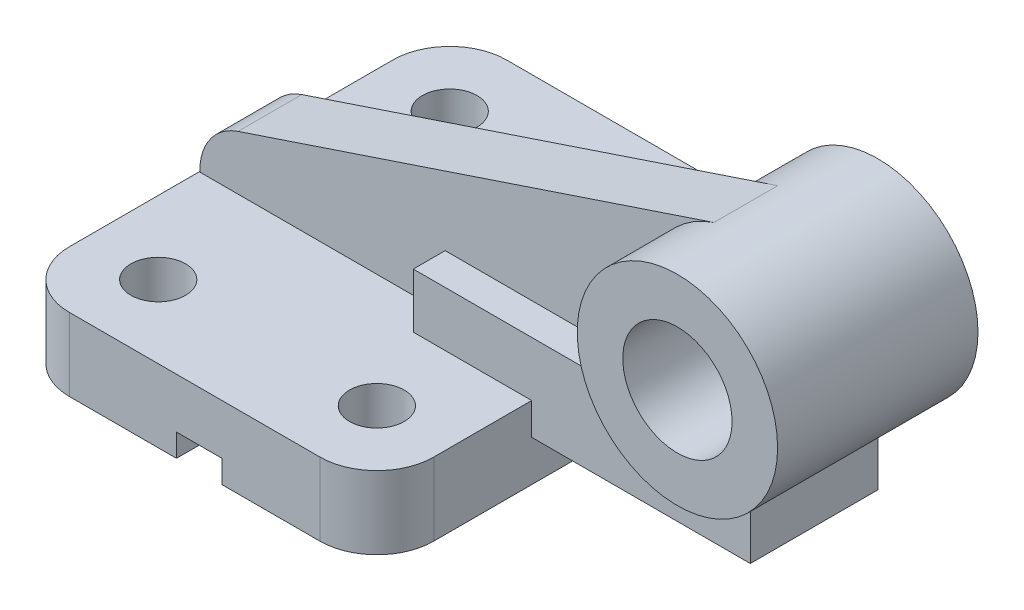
ISO-10303-21;
HEADER;
FILE_DESCRIPTION(('STEP AP214'),'2;1');
FILE_NAME('part.step','',(''),(''),'','','');
FILE_SCHEMA(('AUTOMOTIVE_DESIGN { 1 0 10303 214 1 1 1 1 }'));
ENDSEC;
DATA;
#1=APPLICATION_CONTEXT('core data for automotive mechanical design processes');
#2=APPLICATION_PROTOCOL_DEFINITION('international standard','automotive_design',2000,#1);
#3=PRODUCT_CONTEXT('',#1,'mechanical');
#4=PRODUCT('Part','Part','',(#3));
#5=PRODUCT_RELATED_PRODUCT_CATEGORY('part','',(#4));
#6=PRODUCT_DEFINITION_FORMATION('','',#4);
#7=PRODUCT_DEFINITION_CONTEXT('part definition',#1,'design');
#8=PRODUCT_DEFINITION('design','',#6,#7);
#9=PRODUCT_DEFINITION_SHAPE('','',#8);
#10=(LENGTH_UNIT() NAMED_UNIT(*) SI_UNIT(.MILLI.,.METRE.));
#11=(NAMED_UNIT(*) PLANE_ANGLE_UNIT() SI_UNIT($,.RADIAN.));
#12=(NAMED_UNIT(*) SI_UNIT($,.STERADIAN.) SOLID_ANGLE_UNIT());
#13=UNCERTAINTY_MEASURE_WITH_UNIT(LENGTH_MEASURE(1.E-05),#10,'distance_accuracy_value','');
#14=(GEOMETRIC_REPRESENTATION_CONTEXT(3) GLOBAL_UNCERTAINTY_ASSIGNED_CONTEXT((#13)) GLOBAL_UNIT_ASSIGNED_CONTEXT((#10,
#11,#12)) REPRESENTATION_CONTEXT('',''));
#15=CARTESIAN_POINT('',(0.,0.,0.));
#16=DIRECTION('',(0.,0.,1.));
#17=DIRECTION('',(1.,0.,0.));
#18=AXIS2_PLACEMENT_3D('',#15,#16,#17);
#19=CARTESIAN_POINT('',(-80.,-84.,-70.9999999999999));
#20=DIRECTION('',(1.,0.,0.));
#21=DIRECTION('',(0.,0.,-1.));
#22=AXIS2_PLACEMENT_3D('',#19,#20,#21);
#23=PLANE('',#22);
#24=DIRECTION('',(0.,0.,-1.));
#25=VECTOR('',#24,1.);
#26=CARTESIAN_POINT('',(-80.,-52.,-70.9999999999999));
#27=LINE('',#26,#25);
#28=CARTESIAN_POINT('',(-80.,-52.,-28.));
#29=VERTEX_POINT('',#28);
#30=CARTESIAN_POINT('',(-80.,-52.,-70.9999999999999));
#31=VERTEX_POINT('',#30);
#32=EDGE_CURVE('E424',#29,#31,#27,.T.);
#33=ORIENTED_EDGE('',*,*,#32,.F.);
#34=DIRECTION('',(0.,-1.,0.));
#35=VECTOR('',#34,1.);
#36=CARTESIAN_POINT('',(-80.,-184.616573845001,-28.));
#37=LINE('',#36,#35);
#38=CARTESIAN_POINT('',(-80.,-66.,-28.));
#39=VERTEX_POINT('',#38);
#40=EDGE_CURVE('E271',#29,#39,#37,.T.);
#41=ORIENTED_EDGE('',*,*,#40,.T.);
#42=DIRECTION('',(0.,0.,1.));
#43=VECTOR('',#42,1.);
#44=CARTESIAN_POINT('',(-80.,-66.,-28.));
#45=LINE('',#44,#43);
#46=CARTESIAN_POINT('',(-80.,-66.,28.));
#47=VERTEX_POINT('',#46);
#48=EDGE_CURVE('E279',#39,#47,#45,.T.);
#49=ORIENTED_EDGE('',*,*,#48,.T.);
#50=DIRECTION('',(0.,-1.,0.));
#51=VECTOR('',#50,1.);
#52=CARTESIAN_POINT('',(-80.,-184.616573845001,28.));
#53=LINE('',#52,#51);
#54=CARTESIAN_POINT('',(-80.,-52.,28.));
#55=VERTEX_POINT('',#54);
#56=EDGE_CURVE('E255',#55,#47,#53,.T.);
#57=ORIENTED_EDGE('',*,*,#56,.F.);
#58=CARTESIAN_POINT('',(-80.,-52.,70.9999999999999));
#59=VERTEX_POINT('',#58);
#60=EDGE_CURVE('E425',#59,#55,#27,.T.);
#61=ORIENTED_EDGE('',*,*,#60,.F.);
#62=DIRECTION('',(0.,1.,0.));
#63=VECTOR('',#62,1.);
#64=CARTESIAN_POINT('',(-80.,-84.,70.9999999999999));
#65=LINE('',#64,#63);
#66=CARTESIAN_POINT('',(-80.,-84.,70.9999999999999));
#67=VERTEX_POINT('',#66);
#68=EDGE_CURVE('E440',#67,#59,#65,.T.);
#69=ORIENTED_EDGE('',*,*,#68,.F.);
#70=DIRECTION('',(0.,0.,-1.));
#71=VECTOR('',#70,1.);
#72=CARTESIAN_POINT('',(-80.,-84.,-70.9999999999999));
#73=LINE('',#72,#71);
#74=CARTESIAN_POINT('',(-80.,-84.,-70.9999999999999));
#75=VERTEX_POINT('',#74);
#76=EDGE_CURVE('E399',#67,#75,#73,.T.);
#77=ORIENTED_EDGE('',*,*,#76,.T.);
#78=DIRECTION('',(0.,1.,0.));
#79=VECTOR('',#78,1.);
#80=CARTESIAN_POINT('',(-80.,-84.,-70.9999999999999));
#81=LINE('',#80,#79);
#82=EDGE_CURVE('E437',#75,#31,#81,.T.);
#83=ORIENTED_EDGE('',*,*,#82,.T.);
#84=EDGE_LOOP('',(#33,#41,#49,#57,#61,#69,#77,#83));
#85=FACE_BOUND('',#84,.T.);
#86=ADVANCED_FACE('F31',(#85),#23,.T.);
#87=CARTESIAN_POINT('',(-215.,-84.,-71.));
#88=DIRECTION('',(0.,-1.,0.));
#89=DIRECTION('',(0.,0.,-1.));
#90=AXIS2_PLACEMENT_3D('',#87,#88,#89);
#91=PLANE('',#90);
#92=DIRECTION('',(0.,0.,-1.));
#93=VECTOR('',#92,1.);
#94=CARTESIAN_POINT('',(-168.,-84.,-71.));
#95=LINE('',#94,#93);
#96=CARTESIAN_POINT('',(-168.,-84.,96.));
#97=VERTEX_POINT('',#96);
#98=CARTESIAN_POINT('',(-168.,-84.,-96.));
#99=VERTEX_POINT('',#98);
#100=EDGE_CURVE('E11',#97,#99,#95,.T.);
#101=ORIENTED_EDGE('',*,*,#100,.F.);
#102=DIRECTION('',(1.,0.,0.));
#103=VECTOR('',#102,1.);
#104=CARTESIAN_POINT('',(-105.,-84.,96.));
#105=LINE('',#104,#103);
#106=CARTESIAN_POINT('',(-215.,-84.,96.));
#107=VERTEX_POINT('',#106);
#108=EDGE_CURVE('E393',#107,#97,#105,.T.);
#109=ORIENTED_EDGE('',*,*,#108,.F.);
#110=CARTESIAN_POINT('',(-215.,-84.,71.));
#111=DIRECTION('',(0.,1.,0.));
#112=DIRECTION('',(0.,0.,-1.));
#113=AXIS2_PLACEMENT_3D('',#110,#111,#112);
#114=CIRCLE('',#113,25.);
#115=CARTESIAN_POINT('',(-240.,-84.,70.9999999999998));
#116=VERTEX_POINT('',#115);
#117=EDGE_CURVE('E389',#116,#107,#114,.T.);
#118=ORIENTED_EDGE('',*,*,#117,.F.);
#119=DIRECTION('',(0.,0.,1.));
#120=VECTOR('',#119,1.);
#121=CARTESIAN_POINT('',(-240.,-84.,70.9999999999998));
#122=LINE('',#121,#120);
#123=CARTESIAN_POINT('',(-240.,-84.,-70.9999999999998));
#124=VERTEX_POINT('',#123);
#125=EDGE_CURVE('E385',#124,#116,#122,.T.);
#126=ORIENTED_EDGE('',*,*,#125,.F.);
#127=CARTESIAN_POINT('',(-215.,-84.,-71.));
#128=DIRECTION('',(0.,1.,0.));
#129=DIRECTION('',(0.,0.,-1.));
#130=AXIS2_PLACEMENT_3D('',#127,#128,#129);
#131=CIRCLE('',#130,25.);
#132=CARTESIAN_POINT('',(-215.,-84.,-96.));
#133=VERTEX_POINT('',#132);
#134=EDGE_CURVE('E382',#133,#124,#131,.T.);
#135=ORIENTED_EDGE('',*,*,#134,.F.);
#136=DIRECTION('',(-1.,0.,0.));
#137=VECTOR('',#136,1.);
#138=CARTESIAN_POINT('',(-215.,-84.,-96.));
#139=LINE('',#138,#137);
#140=EDGE_CURVE('E405',#99,#133,#139,.T.);
#141=ORIENTED_EDGE('',*,*,#140,.F.);
#142=EDGE_LOOP('',(#101,#109,#118,#126,#135,#141));
#143=FACE_BOUND('',#142,.T.);
#144=CARTESIAN_POINT('',(-208.,-84.,64.));
#145=DIRECTION('',(0.,1.,0.));
#146=DIRECTION('',(0.,0.,1.));
#147=AXIS2_PLACEMENT_3D('',#144,#145,#146);
#148=CIRCLE('',#147,12.);
#149=CARTESIAN_POINT('',(-208.,-84.,76.));
#150=VERTEX_POINT('',#149);
#151=EDGE_CURVE('E355',#150,#150,#148,.T.);
#152=ORIENTED_EDGE('',*,*,#151,.T.);
#153=EDGE_LOOP('',(#152));
#154=FACE_BOUND('',#153,.T.);
#155=CARTESIAN_POINT('',(-208.,-84.,-64.));
#156=DIRECTION('',(0.,-1.,0.));
#157=DIRECTION('',(0.,0.,-1.));
#158=AXIS2_PLACEMENT_3D('',#155,#156,#157);
#159=CIRCLE('',#158,12.);
#160=CARTESIAN_POINT('',(-208.,-84.,-76.));
#161=VERTEX_POINT('',#160);
#162=EDGE_CURVE('E349',#161,#161,#159,.T.);
#163=ORIENTED_EDGE('',*,*,#162,.F.);
#164=EDGE_LOOP('',(#163));
#165=FACE_BOUND('',#164,.T.);
#166=ADVANCED_FACE('F480',(#143,#154,#165),#91,.T.);
#167=CARTESIAN_POINT('',(-215.,-52.,-71.));
#168=DIRECTION('',(0.,-1.,0.));
#169=DIRECTION('',(0.,0.,-1.));
#170=AXIS2_PLACEMENT_3D('',#167,#168,#169);
#171=PLANE('',#170);
#172=CARTESIAN_POINT('',(-112.,-52.,-64.));
#173=DIRECTION('',(0.,1.,0.));
#174=DIRECTION('',(0.,0.,1.));
#175=AXIS2_PLACEMENT_3D('',#172,#173,#174);
#176=CIRCLE('',#175,12.);
#177=CARTESIAN_POINT('',(-112.,-52.,-52.));
#178=VERTEX_POINT('',#177);
#179=EDGE_CURVE('E332',#178,#178,#176,.T.);
#180=ORIENTED_EDGE('',*,*,#179,.F.);
#181=EDGE_LOOP('',(#180));
#182=FACE_BOUND('',#181,.T.);
#183=CARTESIAN_POINT('',(-112.,-52.,64.));
#184=DIRECTION('',(0.,1.,0.));
#185=DIRECTION('',(0.,0.,1.));
#186=AXIS2_PLACEMENT_3D('',#183,#184,#185);
#187=CIRCLE('',#186,12.);
#188=CARTESIAN_POINT('',(-112.,-52.,76.));
#189=VERTEX_POINT('',#188);
#190=EDGE_CURVE('E340',#189,#189,#187,.T.);
#191=ORIENTED_EDGE('',*,*,#190,.F.);
#192=EDGE_LOOP('',(#191));
#193=FACE_BOUND('',#192,.T.);
#194=DIRECTION('',(1.,0.,0.));
#195=VECTOR('',#194,1.);
#196=CARTESIAN_POINT('',(-239.716547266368,-52.,-14.));
#197=LINE('',#196,#195);
#198=CARTESIAN_POINT('',(-239.716547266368,-52.,-14.));
#199=VERTEX_POINT('',#198);
#200=CARTESIAN_POINT('',(-132.,-52.,-14.));
#201=VERTEX_POINT('',#200);
#202=EDGE_CURVE('E322',#199,#201,#197,.T.);
#203=ORIENTED_EDGE('',*,*,#202,.T.);
#204=DIRECTION('',(0.,0.,1.));
#205=VECTOR('',#204,1.);
#206=CARTESIAN_POINT('',(-132.,-52.,-28.));
#207=LINE('',#206,#205);
#208=CARTESIAN_POINT('',(-132.,-52.,-28.));
#209=VERTEX_POINT('',#208);
#210=EDGE_CURVE('E282',#209,#201,#207,.T.);
#211=ORIENTED_EDGE('',*,*,#210,.F.);
#212=DIRECTION('',(1.,0.,0.));
#213=VECTOR('',#212,1.);
#214=CARTESIAN_POINT('',(-37.1698318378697,-52.,-28.));
#215=LINE('',#214,#213);
#216=EDGE_CURVE('E268',#209,#29,#215,.T.);
#217=ORIENTED_EDGE('',*,*,#216,.T.);
#218=ORIENTED_EDGE('',*,*,#32,.T.);
#219=CARTESIAN_POINT('',(-105.,-52.,-71.));
#220=DIRECTION('',(0.,1.,0.));
#221=DIRECTION('',(0.,0.,1.));
#222=AXIS2_PLACEMENT_3D('',#219,#220,#221);
#223=CIRCLE('',#222,25.);
#224=CARTESIAN_POINT('',(-105.,-52.,-96.));
#225=VERTEX_POINT('',#224);
#226=EDGE_CURVE('E428',#31,#225,#223,.T.);
#227=ORIENTED_EDGE('',*,*,#226,.T.);
#228=DIRECTION('',(-1.,0.,0.));
#229=VECTOR('',#228,1.);
#230=CARTESIAN_POINT('',(-215.,-52.,-96.));
#231=LINE('',#230,#229);
#232=CARTESIAN_POINT('',(-215.,-52.,-96.));
#233=VERTEX_POINT('',#232);
#234=EDGE_CURVE('E386',#225,#233,#231,.T.);
#235=ORIENTED_EDGE('',*,*,#234,.T.);
#236=CARTESIAN_POINT('',(-215.,-52.,-71.));
#237=DIRECTION('',(0.,1.,0.));
#238=DIRECTION('',(0.,0.,-1.));
#239=AXIS2_PLACEMENT_3D('',#236,#237,#238);
#240=CIRCLE('',#239,25.);
#241=CARTESIAN_POINT('',(-240.,-52.,-70.9999999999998));
#242=VERTEX_POINT('',#241);
#243=EDGE_CURVE('E379',#233,#242,#240,.T.);
#244=ORIENTED_EDGE('',*,*,#243,.T.);
#245=DIRECTION('',(0.,0.,1.));
#246=VECTOR('',#245,1.);
#247=CARTESIAN_POINT('',(-240.,-52.,70.9999999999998));
#248=LINE('',#247,#246);
#249=CARTESIAN_POINT('',(-240.,-52.,70.9999999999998));
#250=VERTEX_POINT('',#249);
#251=EDGE_CURVE('E412',#242,#250,#248,.T.);
#252=ORIENTED_EDGE('',*,*,#251,.T.);
#253=CARTESIAN_POINT('',(-215.,-52.,71.));
#254=DIRECTION('',(0.,1.,0.));
#255=DIRECTION('',(0.,0.,-1.));
#256=AXIS2_PLACEMENT_3D('',#253,#254,#255);
#257=CIRCLE('',#256,25.);
#258=CARTESIAN_POINT('',(-215.,-52.,96.));
#259=VERTEX_POINT('',#258);
#260=EDGE_CURVE('E415',#250,#259,#257,.T.);
#261=ORIENTED_EDGE('',*,*,#260,.T.);
#262=DIRECTION('',(1.,0.,0.));
#263=VECTOR('',#262,1.);
#264=CARTESIAN_POINT('',(-105.,-52.,96.));
#265=LINE('',#264,#263);
#266=CARTESIAN_POINT('',(-105.,-52.,96.));
#267=VERTEX_POINT('',#266);
#268=EDGE_CURVE('E418',#259,#267,#265,.T.);
#269=ORIENTED_EDGE('',*,*,#268,.T.);
#270=CARTESIAN_POINT('',(-105.,-52.,71.));
#271=DIRECTION('',(0.,1.,0.));
#272=DIRECTION('',(0.,0.,1.));
#273=AXIS2_PLACEMENT_3D('',#270,#271,#272);
#274=CIRCLE('',#273,25.);
#275=EDGE_CURVE('E421',#267,#59,#274,.T.);
#276=ORIENTED_EDGE('',*,*,#275,.T.);
#277=ORIENTED_EDGE('',*,*,#60,.T.);
#278=DIRECTION('',(1.,0.,0.));
#279=VECTOR('',#278,1.);
#280=CARTESIAN_POINT('',(-37.1698318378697,-52.,28.));
#281=LINE('',#280,#279);
#282=CARTESIAN_POINT('',(-132.,-52.,28.));
#283=VERTEX_POINT('',#282);
#284=EDGE_CURVE('E253',#283,#55,#281,.T.);
#285=ORIENTED_EDGE('',*,*,#284,.F.);
#286=CARTESIAN_POINT('',(-132.,-52.,14.));
#287=VERTEX_POINT('',#286);
#288=EDGE_CURVE('E284',#287,#283,#207,.T.);
#289=ORIENTED_EDGE('',*,*,#288,.F.);
#290=DIRECTION('',(1.,0.,0.));
#291=VECTOR('',#290,1.);
#292=CARTESIAN_POINT('',(-239.716547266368,-52.,14.));
#293=LINE('',#292,#291);
#294=CARTESIAN_POINT('',(-239.716547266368,-52.,14.));
#295=VERTEX_POINT('',#294);
#296=EDGE_CURVE('E51',#295,#287,#293,.T.);
#297=ORIENTED_EDGE('',*,*,#296,.F.);
#298=DIRECTION('',(0.,0.,1.));
#299=VECTOR('',#298,1.);
#300=CARTESIAN_POINT('',(-239.716547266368,-52.,-14.));
#301=LINE('',#300,#299);
#302=EDGE_CURVE('E46',#199,#295,#301,.T.);
#303=ORIENTED_EDGE('',*,*,#302,.F.);
#304=EDGE_LOOP('',(#203,#211,#217,#218,#227,#235,#244,#252,#261,#269,#276,#277,#285,#289,#297,#303));
#305=FACE_BOUND('',#304,.T.);
#306=CARTESIAN_POINT('',(-208.,-52.,64.));
#307=DIRECTION('',(0.,1.,0.));
#308=DIRECTION('',(0.,0.,1.));
#309=AXIS2_PLACEMENT_3D('',#306,#307,#308);
#310=CIRCLE('',#309,12.);
#311=CARTESIAN_POINT('',(-208.,-52.,76.));
#312=VERTEX_POINT('',#311);
#313=EDGE_CURVE('E352',#312,#312,#310,.T.);
#314=ORIENTED_EDGE('',*,*,#313,.F.);
#315=EDGE_LOOP('',(#314));
#316=FACE_BOUND('',#315,.T.);
#317=CARTESIAN_POINT('',(-208.,-52.,-64.));
#318=DIRECTION('',(0.,-1.,0.));
#319=DIRECTION('',(0.,0.,-1.));
#320=AXIS2_PLACEMENT_3D('',#317,#318,#319);
#321=CIRCLE('',#320,12.);
#322=CARTESIAN_POINT('',(-208.,-52.,-76.));
#323=VERTEX_POINT('',#322);
#324=EDGE_CURVE('E346',#323,#323,#321,.T.);
#325=ORIENTED_EDGE('',*,*,#324,.T.);
#326=EDGE_LOOP('',(#325));
#327=FACE_BOUND('',#326,.T.);
#328=ADVANCED_FACE('F471',(#182,#193,#305,#316,#327),#171,.F.);
#329=CARTESIAN_POINT('',(-215.,-84.,-71.));
#330=DIRECTION('',(0.,1.,0.));
#331=DIRECTION('',(0.,0.,1.));
#332=AXIS2_PLACEMENT_3D('',#329,#330,#331);
#333=CYLINDRICAL_SURFACE('',#332,25.);
#334=ORIENTED_EDGE('',*,*,#243,.F.);
#335=DIRECTION('',(0.,1.,0.));
#336=VECTOR('',#335,1.);
#337=CARTESIAN_POINT('',(-215.,-84.,-96.));
#338=LINE('',#337,#336);
#339=EDGE_CURVE('E433',#133,#233,#338,.T.);
#340=ORIENTED_EDGE('',*,*,#339,.F.);
#341=ORIENTED_EDGE('',*,*,#134,.T.);
#342=DIRECTION('',(0.,1.,0.));
#343=VECTOR('',#342,1.);
#344=CARTESIAN_POINT('',(-240.,-84.,-70.9999999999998));
#345=LINE('',#344,#343);
#346=EDGE_CURVE('E409',#124,#242,#345,.T.);
#347=ORIENTED_EDGE('',*,*,#346,.T.);
#348=EDGE_LOOP('',(#334,#340,#341,#347));
#349=FACE_BOUND('',#348,.T.);
#350=ADVANCED_FACE('F33',(#349),#333,.T.);
#351=CARTESIAN_POINT('',(-215.,-84.,-96.));
#352=DIRECTION('',(0.,0.,-1.));
#353=DIRECTION('',(-1.,0.,0.));
#354=AXIS2_PLACEMENT_3D('',#351,#352,#353);
#355=PLANE('',#354);
#356=DIRECTION('',(0.,-1.,0.));
#357=VECTOR('',#356,1.);
#358=CARTESIAN_POINT('',(-168.,-74.,-96.));
#359=LINE('',#358,#357);
#360=CARTESIAN_POINT('',(-168.,-74.,-96.));
#361=VERTEX_POINT('',#360);
#362=EDGE_CURVE('E361',#361,#99,#359,.T.);
#363=ORIENTED_EDGE('',*,*,#362,.T.);
#364=ORIENTED_EDGE('',*,*,#140,.T.);
#365=ORIENTED_EDGE('',*,*,#339,.T.);
#366=ORIENTED_EDGE('',*,*,#234,.F.);
#367=DIRECTION('',(0.,1.,0.));
#368=VECTOR('',#367,1.);
#369=CARTESIAN_POINT('',(-105.,-84.,-96.));
#370=LINE('',#369,#368);
#371=CARTESIAN_POINT('',(-105.,-84.,-96.));
#372=VERTEX_POINT('',#371);
#373=EDGE_CURVE('E435',#372,#225,#370,.T.);
#374=ORIENTED_EDGE('',*,*,#373,.F.);
#375=CARTESIAN_POINT('',(-148.,-84.,-96.));
#376=VERTEX_POINT('',#375);
#377=EDGE_CURVE('E406',#372,#376,#139,.T.);
#378=ORIENTED_EDGE('',*,*,#377,.T.);
#379=DIRECTION('',(0.,1.,0.));
#380=VECTOR('',#379,1.);
#381=CARTESIAN_POINT('',(-148.,-74.,-96.));
#382=LINE('',#381,#380);
#383=CARTESIAN_POINT('',(-148.,-74.,-96.));
#384=VERTEX_POINT('',#383);
#385=EDGE_CURVE('E364',#376,#384,#382,.T.);
#386=ORIENTED_EDGE('',*,*,#385,.T.);
#387=DIRECTION('',(-1.,0.,0.));
#388=VECTOR('',#387,1.);
#389=CARTESIAN_POINT('',(-168.,-74.,-96.));
#390=LINE('',#389,#388);
#391=EDGE_CURVE('E368',#384,#361,#390,.T.);
#392=ORIENTED_EDGE('',*,*,#391,.T.);
#393=EDGE_LOOP('',(#363,#364,#365,#366,#374,#378,#386,#392));
#394=FACE_BOUND('',#393,.T.);
#395=ADVANCED_FACE('F490',(#394),#355,.T.);
#396=CARTESIAN_POINT('',(-105.,-84.,-71.));
#397=DIRECTION('',(0.,1.,0.));
#398=DIRECTION('',(0.,0.,1.));
#399=AXIS2_PLACEMENT_3D('',#396,#397,#398);
#400=CYLINDRICAL_SURFACE('',#399,25.);
#401=ORIENTED_EDGE('',*,*,#226,.F.);
#402=ORIENTED_EDGE('',*,*,#82,.F.);
#403=CARTESIAN_POINT('',(-105.,-84.,-71.));
#404=DIRECTION('',(0.,1.,0.));
#405=DIRECTION('',(0.,0.,1.));
#406=AXIS2_PLACEMENT_3D('',#403,#404,#405);
#407=CIRCLE('',#406,25.);
#408=EDGE_CURVE('E402',#75,#372,#407,.T.);
#409=ORIENTED_EDGE('',*,*,#408,.T.);
#410=ORIENTED_EDGE('',*,*,#373,.T.);
#411=EDGE_LOOP('',(#401,#402,#409,#410));
#412=FACE_BOUND('',#411,.T.);
#413=ADVANCED_FACE('F556',(#412),#400,.T.);
#414=CARTESIAN_POINT('',(-105.,-84.,71.));
#415=DIRECTION('',(0.,1.,0.));
#416=DIRECTION('',(0.,0.,1.));
#417=AXIS2_PLACEMENT_3D('',#414,#415,#416);
#418=CYLINDRICAL_SURFACE('',#417,25.);
#419=ORIENTED_EDGE('',*,*,#275,.F.);
#420=DIRECTION('',(0.,1.,0.));
#421=VECTOR('',#420,1.);
#422=CARTESIAN_POINT('',(-105.,-84.,96.));
#423=LINE('',#422,#421);
#424=CARTESIAN_POINT('',(-105.,-84.,96.));
#425=VERTEX_POINT('',#424);
#426=EDGE_CURVE('E442',#425,#267,#423,.T.);
#427=ORIENTED_EDGE('',*,*,#426,.F.);
#428=CARTESIAN_POINT('',(-105.,-84.,71.));
#429=DIRECTION('',(0.,1.,0.));
#430=DIRECTION('',(0.,0.,1.));
#431=AXIS2_PLACEMENT_3D('',#428,#429,#430);
#432=CIRCLE('',#431,25.);
#433=EDGE_CURVE('E396',#425,#67,#432,.T.);
#434=ORIENTED_EDGE('',*,*,#433,.T.);
#435=ORIENTED_EDGE('',*,*,#68,.T.);
#436=EDGE_LOOP('',(#419,#427,#434,#435));
#437=FACE_BOUND('',#436,.T.);
#438=ADVANCED_FACE('F466',(#437),#418,.T.);
#439=CARTESIAN_POINT('',(-105.,-84.,96.));
#440=DIRECTION('',(0.,0.,1.));
#441=DIRECTION('',(1.,0.,0.));
#442=AXIS2_PLACEMENT_3D('',#439,#440,#441);
#443=PLANE('',#442);
#444=DIRECTION('',(0.,-1.,0.));
#445=VECTOR('',#444,1.);
#446=CARTESIAN_POINT('',(-168.,-74.,96.));
#447=LINE('',#446,#445);
#448=CARTESIAN_POINT('',(-168.,-74.,96.));
#449=VERTEX_POINT('',#448);
#450=EDGE_CURVE('E358',#449,#97,#447,.T.);
#451=ORIENTED_EDGE('',*,*,#450,.F.);
#452=DIRECTION('',(-1.,0.,0.));
#453=VECTOR('',#452,1.);
#454=CARTESIAN_POINT('',(-168.,-74.,96.));
#455=LINE('',#454,#453);
#456=CARTESIAN_POINT('',(-148.,-74.,96.));
#457=VERTEX_POINT('',#456);
#458=EDGE_CURVE('E365',#457,#449,#455,.T.);
#459=ORIENTED_EDGE('',*,*,#458,.F.);
#460=DIRECTION('',(0.,1.,0.));
#461=VECTOR('',#460,1.);
#462=CARTESIAN_POINT('',(-148.,-74.,96.));
#463=LINE('',#462,#461);
#464=CARTESIAN_POINT('',(-148.,-84.,96.));
#465=VERTEX_POINT('',#464);
#466=EDGE_CURVE('E373',#465,#457,#463,.T.);
#467=ORIENTED_EDGE('',*,*,#466,.F.);
#468=EDGE_CURVE('E392',#465,#425,#105,.T.);
#469=ORIENTED_EDGE('',*,*,#468,.T.);
#470=ORIENTED_EDGE('',*,*,#426,.T.);
#471=ORIENTED_EDGE('',*,*,#268,.F.);
#472=DIRECTION('',(0.,1.,0.));
#473=VECTOR('',#472,1.);
#474=CARTESIAN_POINT('',(-215.,-84.,96.));
#475=LINE('',#474,#473);
#476=EDGE_CURVE('E444',#107,#259,#475,.T.);
#477=ORIENTED_EDGE('',*,*,#476,.F.);
#478=ORIENTED_EDGE('',*,*,#108,.T.);
#479=EDGE_LOOP('',(#451,#459,#467,#469,#470,#471,#477,#478));
#480=FACE_BOUND('',#479,.T.);
#481=ADVANCED_FACE('F458',(#480),#443,.T.);
#482=CARTESIAN_POINT('',(-215.,-84.,71.));
#483=DIRECTION('',(0.,1.,0.));
#484=DIRECTION('',(0.,0.,1.));
#485=AXIS2_PLACEMENT_3D('',#482,#483,#484);
#486=CYLINDRICAL_SURFACE('',#485,25.);
#487=ORIENTED_EDGE('',*,*,#260,.F.);
#488=DIRECTION('',(0.,1.,0.));
#489=VECTOR('',#488,1.);
#490=CARTESIAN_POINT('',(-240.,-84.,70.9999999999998));
#491=LINE('',#490,#489);
#492=EDGE_CURVE('E446',#116,#250,#491,.T.);
#493=ORIENTED_EDGE('',*,*,#492,.F.);
#494=ORIENTED_EDGE('',*,*,#117,.T.);
#495=ORIENTED_EDGE('',*,*,#476,.T.);
#496=EDGE_LOOP('',(#487,#493,#494,#495));
#497=FACE_BOUND('',#496,.T.);
#498=ADVANCED_FACE('F475',(#497),#486,.T.);
#499=CARTESIAN_POINT('',(-240.,-84.,70.9999999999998));
#500=DIRECTION('',(-1.,0.,0.));
#501=DIRECTION('',(0.,0.,1.));
#502=AXIS2_PLACEMENT_3D('',#499,#500,#501);
#503=PLANE('',#502);
#504=ORIENTED_EDGE('',*,*,#251,.F.);
#505=ORIENTED_EDGE('',*,*,#346,.F.);
#506=ORIENTED_EDGE('',*,*,#125,.T.);
#507=ORIENTED_EDGE('',*,*,#492,.T.);
#508=EDGE_LOOP('',(#504,#505,#506,#507));
#509=FACE_BOUND('',#508,.T.);
#510=ADVANCED_FACE('F484',(#509),#503,.T.);
#511=CARTESIAN_POINT('',(-112.,-84.,-64.));
#512=DIRECTION('',(0.,1.,0.));
#513=DIRECTION('',(0.,0.,1.));
#514=AXIS2_PLACEMENT_3D('',#511,#512,#513);
#515=CIRCLE('',#514,12.);
#516=CARTESIAN_POINT('',(-112.,-84.,-52.));
#517=VERTEX_POINT('',#516);
#518=EDGE_CURVE('E337',#517,#517,#515,.T.);
#519=ORIENTED_EDGE('',*,*,#518,.T.);
#520=EDGE_LOOP('',(#519));
#521=FACE_BOUND('',#520,.T.);
#522=CARTESIAN_POINT('',(-112.,-84.,64.));
#523=DIRECTION('',(0.,1.,0.));
#524=DIRECTION('',(0.,0.,1.));
#525=AXIS2_PLACEMENT_3D('',#522,#523,#524);
#526=CIRCLE('',#525,12.);
#527=CARTESIAN_POINT('',(-112.,-84.,76.));
#528=VERTEX_POINT('',#527);
#529=EDGE_CURVE('E343',#528,#528,#526,.T.);
#530=ORIENTED_EDGE('',*,*,#529,.T.);
#531=EDGE_LOOP('',(#530));
#532=FACE_BOUND('',#531,.T.);
#533=DIRECTION('',(0.,0.,1.));
#534=VECTOR('',#533,1.);
#535=CARTESIAN_POINT('',(-148.,-84.,-71.));
#536=LINE('',#535,#534);
#537=EDGE_CURVE('E39',#376,#465,#536,.T.);
#538=ORIENTED_EDGE('',*,*,#537,.F.);
#539=ORIENTED_EDGE('',*,*,#377,.F.);
#540=ORIENTED_EDGE('',*,*,#408,.F.);
#541=ORIENTED_EDGE('',*,*,#76,.F.);
#542=ORIENTED_EDGE('',*,*,#433,.F.);
#543=ORIENTED_EDGE('',*,*,#468,.F.);
#544=EDGE_LOOP('',(#538,#539,#540,#541,#542,#543));
#545=FACE_BOUND('',#544,.T.);
#546=ADVANCED_FACE('F461',(#521,#532,#545),#91,.T.);
#547=CARTESIAN_POINT('',(-168.,-74.,-96.));
#548=DIRECTION('',(-1.,0.,0.));
#549=DIRECTION('',(0.,0.,1.));
#550=AXIS2_PLACEMENT_3D('',#547,#548,#549);
#551=PLANE('',#550);
#552=ORIENTED_EDGE('',*,*,#100,.T.);
#553=ORIENTED_EDGE('',*,*,#362,.F.);
#554=DIRECTION('',(0.,0.,1.));
#555=VECTOR('',#554,1.);
#556=CARTESIAN_POINT('',(-168.,-74.,-96.));
#557=LINE('',#556,#555);
#558=EDGE_CURVE('E377',#361,#449,#557,.T.);
#559=ORIENTED_EDGE('',*,*,#558,.T.);
#560=ORIENTED_EDGE('',*,*,#450,.T.);
#561=EDGE_LOOP('',(#552,#553,#559,#560));
#562=FACE_BOUND('',#561,.T.);
#563=ADVANCED_FACE('F495',(#562),#551,.F.);
#564=CARTESIAN_POINT('',(-168.,-74.,-96.));
#565=DIRECTION('',(0.,1.,0.));
#566=DIRECTION('',(0.,0.,1.));
#567=AXIS2_PLACEMENT_3D('',#564,#565,#566);
#568=PLANE('',#567);
#569=ORIENTED_EDGE('',*,*,#458,.T.);
#570=ORIENTED_EDGE('',*,*,#558,.F.);
#571=ORIENTED_EDGE('',*,*,#391,.F.);
#572=DIRECTION('',(0.,0.,1.));
#573=VECTOR('',#572,1.);
#574=CARTESIAN_POINT('',(-148.,-74.,-96.));
#575=LINE('',#574,#573);
#576=EDGE_CURVE('E371',#384,#457,#575,.T.);
#577=ORIENTED_EDGE('',*,*,#576,.T.);
#578=EDGE_LOOP('',(#569,#570,#571,#577));
#579=FACE_BOUND('',#578,.T.);
#580=ADVANCED_FACE('F497',(#579),#568,.F.);
#581=CARTESIAN_POINT('',(-148.,-74.,-96.));
#582=DIRECTION('',(1.,0.,0.));
#583=DIRECTION('',(0.,0.,-1.));
#584=AXIS2_PLACEMENT_3D('',#581,#582,#583);
#585=PLANE('',#584);
#586=ORIENTED_EDGE('',*,*,#537,.T.);
#587=ORIENTED_EDGE('',*,*,#466,.T.);
#588=ORIENTED_EDGE('',*,*,#576,.F.);
#589=ORIENTED_EDGE('',*,*,#385,.F.);
#590=EDGE_LOOP('',(#586,#587,#588,#589));
#591=FACE_BOUND('',#590,.T.);
#592=ADVANCED_FACE('F451',(#591),#585,.F.);
#593=CARTESIAN_POINT('',(-208.,-84.,64.));
#594=DIRECTION('',(0.,1.,0.));
#595=DIRECTION('',(0.,0.,1.));
#596=AXIS2_PLACEMENT_3D('',#593,#594,#595);
#597=CYLINDRICAL_SURFACE('',#596,12.);
#598=ORIENTED_EDGE('',*,*,#151,.F.);
#599=EDGE_LOOP('',(#598));
#600=FACE_BOUND('',#599,.T.);
#601=ORIENTED_EDGE('',*,*,#313,.T.);
#602=EDGE_LOOP('',(#601));
#603=FACE_BOUND('',#602,.T.);
#604=ADVANCED_FACE('F601',(#600,#603),#597,.F.);
#605=CARTESIAN_POINT('',(-208.,-84.,-64.));
#606=DIRECTION('',(0.,1.,0.));
#607=DIRECTION('',(0.,0.,1.));
#608=AXIS2_PLACEMENT_3D('',#605,#606,#607);
#609=CYLINDRICAL_SURFACE('',#608,12.);
#610=ORIENTED_EDGE('',*,*,#162,.T.);
#611=EDGE_LOOP('',(#610));
#612=FACE_BOUND('',#611,.T.);
#613=ORIENTED_EDGE('',*,*,#324,.F.);
#614=EDGE_LOOP('',(#613));
#615=FACE_BOUND('',#614,.T.);
#616=ADVANCED_FACE('F606',(#612,#615),#609,.F.);
#617=CARTESIAN_POINT('',(-112.,-84.,64.));
#618=DIRECTION('',(0.,1.,0.));
#619=DIRECTION('',(0.,0.,1.));
#620=AXIS2_PLACEMENT_3D('',#617,#618,#619);
#621=CYLINDRICAL_SURFACE('',#620,12.);
#622=ORIENTED_EDGE('',*,*,#529,.F.);
#623=EDGE_LOOP('',(#622));
#624=FACE_BOUND('',#623,.T.);
#625=ORIENTED_EDGE('',*,*,#190,.T.);
#626=EDGE_LOOP('',(#625));
#627=FACE_BOUND('',#626,.T.);
#628=ADVANCED_FACE('F609',(#624,#627),#621,.F.);
#629=CARTESIAN_POINT('',(-112.,-84.,-64.));
#630=DIRECTION('',(0.,1.,0.));
#631=DIRECTION('',(0.,0.,1.));
#632=AXIS2_PLACEMENT_3D('',#629,#630,#631);
#633=CYLINDRICAL_SURFACE('',#632,12.);
#634=ORIENTED_EDGE('',*,*,#518,.F.);
#635=EDGE_LOOP('',(#634));
#636=FACE_BOUND('',#635,.T.);
#637=ORIENTED_EDGE('',*,*,#179,.T.);
#638=EDGE_LOOP('',(#637));
#639=FACE_BOUND('',#638,.T.);
#640=ADVANCED_FACE('F626',(#636,#639),#633,.F.);
#641=CARTESIAN_POINT('',(-215.184649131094,-51.3980510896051,-14.));
#642=DIRECTION('',(0.,0.,1.));
#643=DIRECTION('',(1.,0.,0.));
#644=AXIS2_PLACEMENT_3D('',#641,#642,#643);
#645=CYLINDRICAL_SURFACE('',#644,24.539282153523);
#646=ORIENTED_EDGE('',*,*,#302,.T.);
#647=CARTESIAN_POINT('',(-215.184649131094,-51.3980510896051,14.));
#648=DIRECTION('',(0.,0.,1.));
#649=DIRECTION('',(1.,0.,0.));
#650=AXIS2_PLACEMENT_3D('',#647,#648,#649);
#651=CIRCLE('',#650,24.539282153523);
#652=CARTESIAN_POINT('',(-222.963011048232,-28.124171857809,14.));
#653=VERTEX_POINT('',#652);
#654=EDGE_CURVE('E300',#653,#295,#651,.T.);
#655=ORIENTED_EDGE('',*,*,#654,.F.);
#656=DIRECTION('',(0.,0.,1.));
#657=VECTOR('',#656,1.);
#658=CARTESIAN_POINT('',(-222.963011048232,-28.124171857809,-14.));
#659=LINE('',#658,#657);
#660=CARTESIAN_POINT('',(-222.963011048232,-28.124171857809,-14.));
#661=VERTEX_POINT('',#660);
#662=EDGE_CURVE('E333',#661,#653,#659,.T.);
#663=ORIENTED_EDGE('',*,*,#662,.F.);
#664=CARTESIAN_POINT('',(-215.184649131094,-51.3980510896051,-14.));
#665=DIRECTION('',(0.,0.,1.));
#666=DIRECTION('',(1.,0.,0.));
#667=AXIS2_PLACEMENT_3D('',#664,#665,#666);
#668=CIRCLE('',#667,24.539282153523);
#669=EDGE_CURVE('E319',#661,#199,#668,.T.);
#670=ORIENTED_EDGE('',*,*,#669,.T.);
#671=EDGE_LOOP('',(#646,#655,#663,#670));
#672=FACE_BOUND('',#671,.T.);
#673=ADVANCED_FACE('F513',(#672),#645,.T.);
#674=CARTESIAN_POINT('',(-13.9469411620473,41.7310775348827,-14.));
#675=DIRECTION('',(-0.316975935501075,0.948433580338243,0.));
#676=DIRECTION('',(-0.948433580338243,-0.316975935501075,0.));
#677=AXIS2_PLACEMENT_3D('',#674,#675,#676);
#678=PLANE('',#677);
#679=ORIENTED_EDGE('',*,*,#662,.T.);
#680=DIRECTION('',(-0.948433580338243,-0.316975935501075,0.));
#681=VECTOR('',#680,1.);
#682=CARTESIAN_POINT('',(-13.9469411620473,41.7310775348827,14.));
#683=LINE('',#682,#681);
#684=CARTESIAN_POINT('',(-13.9469411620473,41.7310775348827,14.));
#685=VERTEX_POINT('',#684);
#686=EDGE_CURVE('E297',#685,#653,#683,.T.);
#687=ORIENTED_EDGE('',*,*,#686,.F.);
#688=DIRECTION('',(0.,0.,1.));
#689=VECTOR('',#688,1.);
#690=CARTESIAN_POINT('',(-13.9469411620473,41.7310775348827,-14.));
#691=LINE('',#690,#689);
#692=CARTESIAN_POINT('',(-13.9469411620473,41.7310775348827,-14.));
#693=VERTEX_POINT('',#692);
#694=EDGE_CURVE('E330',#693,#685,#691,.T.);
#695=ORIENTED_EDGE('',*,*,#694,.F.);
#696=DIRECTION('',(-0.948433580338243,-0.316975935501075,0.));
#697=VECTOR('',#696,1.);
#698=CARTESIAN_POINT('',(-13.9469411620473,41.7310775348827,-14.));
#699=LINE('',#698,#697);
#700=EDGE_CURVE('E316',#693,#661,#699,.T.);
#701=ORIENTED_EDGE('',*,*,#700,.T.);
#702=EDGE_LOOP('',(#679,#687,#695,#701));
#703=FACE_BOUND('',#702,.T.);
#704=ADVANCED_FACE('F521',(#703),#678,.T.);
#705=CARTESIAN_POINT('',(0.,0.,-14.));
#706=DIRECTION('',(0.,0.,-1.));
#707=DIRECTION('',(-1.,0.,0.));
#708=AXIS2_PLACEMENT_3D('',#705,#706,#707);
#709=PLANE('',#708);
#710=CARTESIAN_POINT('',(0.,0.,-14.));
#711=DIRECTION('',(0.,0.,-1.));
#712=DIRECTION('',(-1.,0.,0.));
#713=AXIS2_PLACEMENT_3D('',#710,#711,#712);
#714=CIRCLE('',#713,44.);
#715=CARTESIAN_POINT('',(-44.,0.,-14.));
#716=VERTEX_POINT('',#715);
#717=EDGE_CURVE('E313',#716,#693,#714,.T.);
#718=ORIENTED_EDGE('',*,*,#717,.F.);
#719=DIRECTION('',(0.,1.,0.));
#720=VECTOR('',#719,1.);
#721=CARTESIAN_POINT('',(-44.,-28.,-14.));
#722=LINE('',#721,#720);
#723=CARTESIAN_POINT('',(-44.,-28.,-14.));
#724=VERTEX_POINT('',#723);
#725=EDGE_CURVE('E328',#724,#716,#722,.T.);
#726=ORIENTED_EDGE('',*,*,#725,.F.);
#727=DIRECTION('',(1.,0.,0.));
#728=VECTOR('',#727,1.);
#729=CARTESIAN_POINT('',(-132.,-28.,-14.));
#730=LINE('',#729,#728);
#731=CARTESIAN_POINT('',(-132.,-28.,-14.));
#732=VERTEX_POINT('',#731);
#733=EDGE_CURVE('E326',#732,#724,#730,.T.);
#734=ORIENTED_EDGE('',*,*,#733,.F.);
#735=DIRECTION('',(0.,1.,0.));
#736=VECTOR('',#735,1.);
#737=CARTESIAN_POINT('',(-132.,-52.,-14.));
#738=LINE('',#737,#736);
#739=EDGE_CURVE('E324',#201,#732,#738,.T.);
#740=ORIENTED_EDGE('',*,*,#739,.F.);
#741=ORIENTED_EDGE('',*,*,#202,.F.);
#742=ORIENTED_EDGE('',*,*,#669,.F.);
#743=ORIENTED_EDGE('',*,*,#700,.F.);
#744=EDGE_LOOP('',(#718,#726,#734,#740,#741,#742,#743));
#745=FACE_BOUND('',#744,.T.);
#746=ADVANCED_FACE('F518',(#745),#709,.T.);
#747=CARTESIAN_POINT('',(0.,0.,14.));
#748=DIRECTION('',(0.,0.,-1.));
#749=DIRECTION('',(-1.,0.,0.));
#750=AXIS2_PLACEMENT_3D('',#747,#748,#749);
#751=PLANE('',#750);
#752=CARTESIAN_POINT('',(0.,0.,14.));
#753=DIRECTION('',(0.,0.,-1.));
#754=DIRECTION('',(-1.,0.,0.));
#755=AXIS2_PLACEMENT_3D('',#752,#753,#754);
#756=CIRCLE('',#755,44.);
#757=CARTESIAN_POINT('',(-44.,0.,14.));
#758=VERTEX_POINT('',#757);
#759=EDGE_CURVE('E230',#758,#685,#756,.T.);
#760=ORIENTED_EDGE('',*,*,#759,.T.);
#761=ORIENTED_EDGE('',*,*,#686,.T.);
#762=ORIENTED_EDGE('',*,*,#654,.T.);
#763=ORIENTED_EDGE('',*,*,#296,.T.);
#764=DIRECTION('',(0.,1.,0.));
#765=VECTOR('',#764,1.);
#766=CARTESIAN_POINT('',(-132.,-52.,14.));
#767=LINE('',#766,#765);
#768=CARTESIAN_POINT('',(-132.,-28.,14.));
#769=VERTEX_POINT('',#768);
#770=EDGE_CURVE('E304',#287,#769,#767,.T.);
#771=ORIENTED_EDGE('',*,*,#770,.T.);
#772=DIRECTION('',(1.,0.,0.));
#773=VECTOR('',#772,1.);
#774=CARTESIAN_POINT('',(-132.,-28.,14.));
#775=LINE('',#774,#773);
#776=CARTESIAN_POINT('',(-44.,-28.,14.));
#777=VERTEX_POINT('',#776);
#778=EDGE_CURVE('E307',#769,#777,#775,.T.);
#779=ORIENTED_EDGE('',*,*,#778,.T.);
#780=DIRECTION('',(0.,1.,0.));
#781=VECTOR('',#780,1.);
#782=CARTESIAN_POINT('',(-44.,-28.,14.));
#783=LINE('',#782,#781);
#784=EDGE_CURVE('E310',#777,#758,#783,.T.);
#785=ORIENTED_EDGE('',*,*,#784,.T.);
#786=EDGE_LOOP('',(#760,#761,#762,#763,#771,#779,#785));
#787=FACE_BOUND('',#786,.T.);
#788=ADVANCED_FACE('F510',(#787),#751,.F.);
#789=CARTESIAN_POINT('',(-132.,-184.616573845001,-28.));
#790=DIRECTION('',(-1.,0.,0.));
#791=DIRECTION('',(0.,0.,1.));
#792=AXIS2_PLACEMENT_3D('',#789,#790,#791);
#793=PLANE('',#792);
#794=ORIENTED_EDGE('',*,*,#770,.F.);
#795=ORIENTED_EDGE('',*,*,#288,.T.);
#796=DIRECTION('',(0.,-1.,0.));
#797=VECTOR('',#796,1.);
#798=CARTESIAN_POINT('',(-132.,-184.616573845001,28.));
#799=LINE('',#798,#797);
#800=CARTESIAN_POINT('',(-132.,-28.,28.));
#801=VERTEX_POINT('',#800);
#802=EDGE_CURVE('E250',#801,#283,#799,.T.);
#803=ORIENTED_EDGE('',*,*,#802,.F.);
#804=DIRECTION('',(0.,0.,1.));
#805=VECTOR('',#804,1.);
#806=CARTESIAN_POINT('',(-132.,-28.,-28.));
#807=LINE('',#806,#805);
#808=EDGE_CURVE('E288',#769,#801,#807,.T.);
#809=ORIENTED_EDGE('',*,*,#808,.F.);
#810=EDGE_LOOP('',(#794,#795,#803,#809));
#811=FACE_BOUND('',#810,.T.);
#812=ADVANCED_FACE('F508',(#811),#793,.T.);
#813=CARTESIAN_POINT('',(-37.1698318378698,-28.,-28.));
#814=DIRECTION('',(0.,1.,0.));
#815=DIRECTION('',(-1.,0.,0.));
#816=AXIS2_PLACEMENT_3D('',#813,#814,#815);
#817=PLANE('',#816);
#818=ORIENTED_EDGE('',*,*,#778,.F.);
#819=ORIENTED_EDGE('',*,*,#808,.T.);
#820=DIRECTION('',(-1.,0.,0.));
#821=VECTOR('',#820,1.);
#822=CARTESIAN_POINT('',(-37.1698318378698,-28.,28.));
#823=LINE('',#822,#821);
#824=CARTESIAN_POINT('',(-44.,-28.,28.));
#825=VERTEX_POINT('',#824);
#826=EDGE_CURVE('E241',#825,#801,#823,.T.);
#827=ORIENTED_EDGE('',*,*,#826,.F.);
#828=DIRECTION('',(0.,0.,1.));
#829=VECTOR('',#828,1.);
#830=CARTESIAN_POINT('',(-44.,-28.,-28.));
#831=LINE('',#830,#829);
#832=EDGE_CURVE('E292',#777,#825,#831,.T.);
#833=ORIENTED_EDGE('',*,*,#832,.F.);
#834=EDGE_LOOP('',(#818,#819,#827,#833));
#835=FACE_BOUND('',#834,.T.);
#836=ADVANCED_FACE('F700',(#835),#817,.T.);
#837=CARTESIAN_POINT('',(-44.,-184.616573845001,-28.));
#838=DIRECTION('',(-1.,0.,0.));
#839=DIRECTION('',(0.,0.,1.));
#840=AXIS2_PLACEMENT_3D('',#837,#838,#839);
#841=PLANE('',#840);
#842=ORIENTED_EDGE('',*,*,#784,.F.);
#843=ORIENTED_EDGE('',*,*,#832,.T.);
#844=DIRECTION('',(0.,-1.,0.));
#845=VECTOR('',#844,1.);
#846=CARTESIAN_POINT('',(-44.,-184.616573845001,28.));
#847=LINE('',#846,#845);
#848=CARTESIAN_POINT('',(-44.,0.,28.));
#849=VERTEX_POINT('',#848);
#850=EDGE_CURVE('E238',#849,#825,#847,.T.);
#851=ORIENTED_EDGE('',*,*,#850,.F.);
#852=DIRECTION('',(0.,0.,1.));
#853=VECTOR('',#852,1.);
#854=CARTESIAN_POINT('',(-44.,0.,-28.));
#855=LINE('',#854,#853);
#856=EDGE_CURVE('E237',#758,#849,#855,.T.);
#857=ORIENTED_EDGE('',*,*,#856,.F.);
#858=EDGE_LOOP('',(#842,#843,#851,#857));
#859=FACE_BOUND('',#858,.T.);
#860=ADVANCED_FACE('F546',(#859),#841,.T.);
#861=CARTESIAN_POINT('',(16.,-184.616573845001,-28.));
#862=DIRECTION('',(1.,0.,0.));
#863=DIRECTION('',(0.,0.,-1.));
#864=AXIS2_PLACEMENT_3D('',#861,#862,#863);
#865=PLANE('',#864);
#866=DIRECTION('',(0.,0.,1.));
#867=VECTOR('',#866,1.);
#868=CARTESIAN_POINT('',(16.,-40.9878030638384,-28.));
#869=LINE('',#868,#867);
#870=CARTESIAN_POINT('',(16.,-40.9878030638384,-28.));
#871=VERTEX_POINT('',#870);
#872=CARTESIAN_POINT('',(16.,-40.9878030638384,28.));
#873=VERTEX_POINT('',#872);
#874=EDGE_CURVE('E224',#871,#873,#869,.T.);
#875=ORIENTED_EDGE('',*,*,#874,.T.);
#876=DIRECTION('',(0.,1.,0.));
#877=VECTOR('',#876,1.);
#878=CARTESIAN_POINT('',(16.,-184.616573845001,28.));
#879=LINE('',#878,#877);
#880=CARTESIAN_POINT('',(16.,-66.,28.));
#881=VERTEX_POINT('',#880);
#882=EDGE_CURVE('E210',#881,#873,#879,.T.);
#883=ORIENTED_EDGE('',*,*,#882,.F.);
#884=DIRECTION('',(0.,0.,1.));
#885=VECTOR('',#884,1.);
#886=CARTESIAN_POINT('',(16.,-66.,-28.));
#887=LINE('',#886,#885);
#888=CARTESIAN_POINT('',(16.,-66.,-28.));
#889=VERTEX_POINT('',#888);
#890=EDGE_CURVE('E231',#889,#881,#887,.T.);
#891=ORIENTED_EDGE('',*,*,#890,.F.);
#892=DIRECTION('',(0.,1.,0.));
#893=VECTOR('',#892,1.);
#894=CARTESIAN_POINT('',(16.,-184.616573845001,-28.));
#895=LINE('',#894,#893);
#896=EDGE_CURVE('E227',#889,#871,#895,.T.);
#897=ORIENTED_EDGE('',*,*,#896,.T.);
#898=EDGE_LOOP('',(#875,#883,#891,#897));
#899=FACE_BOUND('',#898,.T.);
#900=ADVANCED_FACE('F225',(#899),#865,.T.);
#901=CARTESIAN_POINT('',(-37.1698318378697,-66.,-28.));
#902=DIRECTION('',(0.,-1.,0.));
#903=DIRECTION('',(0.,0.,-1.));
#904=AXIS2_PLACEMENT_3D('',#901,#902,#903);
#905=PLANE('',#904);
#906=ORIENTED_EDGE('',*,*,#890,.T.);
#907=DIRECTION('',(1.,0.,0.));
#908=VECTOR('',#907,1.);
#909=CARTESIAN_POINT('',(-37.1698318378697,-66.,28.));
#910=LINE('',#909,#908);
#911=EDGE_CURVE('E218',#47,#881,#910,.T.);
#912=ORIENTED_EDGE('',*,*,#911,.F.);
#913=ORIENTED_EDGE('',*,*,#48,.F.);
#914=DIRECTION('',(1.,0.,0.));
#915=VECTOR('',#914,1.);
#916=CARTESIAN_POINT('',(-37.1698318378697,-66.,-28.));
#917=LINE('',#916,#915);
#918=EDGE_CURVE('E274',#39,#889,#917,.T.);
#919=ORIENTED_EDGE('',*,*,#918,.T.);
#920=EDGE_LOOP('',(#906,#912,#913,#919));
#921=FACE_BOUND('',#920,.T.);
#922=ADVANCED_FACE('F538',(#921),#905,.T.);
#923=ORIENTED_EDGE('',*,*,#210,.T.);
#924=ORIENTED_EDGE('',*,*,#739,.T.);
#925=CARTESIAN_POINT('',(-132.,-28.,-28.));
#926=VERTEX_POINT('',#925);
#927=EDGE_CURVE('E285',#926,#732,#807,.T.);
#928=ORIENTED_EDGE('',*,*,#927,.F.);
#929=DIRECTION('',(0.,-1.,0.));
#930=VECTOR('',#929,1.);
#931=CARTESIAN_POINT('',(-132.,-184.616573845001,-28.));
#932=LINE('',#931,#930);
#933=EDGE_CURVE('E265',#926,#209,#932,.T.);
#934=ORIENTED_EDGE('',*,*,#933,.T.);
#935=EDGE_LOOP('',(#923,#924,#928,#934));
#936=FACE_BOUND('',#935,.T.);
#937=ADVANCED_FACE('F535',(#936),#793,.T.);
#938=ORIENTED_EDGE('',*,*,#927,.T.);
#939=ORIENTED_EDGE('',*,*,#733,.T.);
#940=CARTESIAN_POINT('',(-44.,-28.,-28.));
#941=VERTEX_POINT('',#940);
#942=EDGE_CURVE('E289',#941,#724,#831,.T.);
#943=ORIENTED_EDGE('',*,*,#942,.F.);
#944=DIRECTION('',(-1.,0.,0.));
#945=VECTOR('',#944,1.);
#946=CARTESIAN_POINT('',(-37.1698318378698,-28.,-28.));
#947=LINE('',#946,#945);
#948=EDGE_CURVE('E262',#941,#926,#947,.T.);
#949=ORIENTED_EDGE('',*,*,#948,.T.);
#950=EDGE_LOOP('',(#938,#939,#943,#949));
#951=FACE_BOUND('',#950,.T.);
#952=ADVANCED_FACE('F529',(#951),#817,.T.);
#953=ORIENTED_EDGE('',*,*,#942,.T.);
#954=ORIENTED_EDGE('',*,*,#725,.T.);
#955=CARTESIAN_POINT('',(-44.,0.,-28.));
#956=VERTEX_POINT('',#955);
#957=EDGE_CURVE('E293',#956,#716,#855,.T.);
#958=ORIENTED_EDGE('',*,*,#957,.F.);
#959=DIRECTION('',(0.,-1.,0.));
#960=VECTOR('',#959,1.);
#961=CARTESIAN_POINT('',(-44.,-184.616573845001,-28.));
#962=LINE('',#961,#960);
#963=EDGE_CURVE('E259',#956,#941,#962,.T.);
#964=ORIENTED_EDGE('',*,*,#963,.T.);
#965=EDGE_LOOP('',(#953,#954,#958,#964));
#966=FACE_BOUND('',#965,.T.);
#967=ADVANCED_FACE('F525',(#966),#841,.T.);
#968=CARTESIAN_POINT('',(-37.1698318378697,-184.616573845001,-28.));
#969=DIRECTION('',(0.,0.,1.));
#970=DIRECTION('',(1.,0.,0.));
#971=AXIS2_PLACEMENT_3D('',#968,#969,#970);
#972=PLANE('',#971);
#973=CARTESIAN_POINT('',(0.,0.,-28.));
#974=DIRECTION('',(0.,0.,1.));
#975=DIRECTION('',(1.,0.,0.));
#976=AXIS2_PLACEMENT_3D('',#973,#974,#975);
#977=CIRCLE('',#976,44.);
#978=EDGE_CURVE('E220',#956,#871,#977,.T.);
#979=ORIENTED_EDGE('',*,*,#978,.T.);
#980=ORIENTED_EDGE('',*,*,#896,.F.);
#981=ORIENTED_EDGE('',*,*,#918,.F.);
#982=ORIENTED_EDGE('',*,*,#40,.F.);
#983=ORIENTED_EDGE('',*,*,#216,.F.);
#984=ORIENTED_EDGE('',*,*,#933,.F.);
#985=ORIENTED_EDGE('',*,*,#948,.F.);
#986=ORIENTED_EDGE('',*,*,#963,.F.);
#987=EDGE_LOOP('',(#979,#980,#981,#982,#983,#984,#985,#986));
#988=FACE_BOUND('',#987,.T.);
#989=ADVANCED_FACE('F532',(#988),#972,.F.);
#990=CARTESIAN_POINT('',(-37.1698318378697,-184.616573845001,28.));
#991=DIRECTION('',(0.,0.,1.));
#992=DIRECTION('',(1.,0.,0.));
#993=AXIS2_PLACEMENT_3D('',#990,#991,#992);
#994=PLANE('',#993);
#995=CARTESIAN_POINT('',(0.,0.,28.));
#996=DIRECTION('',(0.,0.,1.));
#997=DIRECTION('',(1.,0.,0.));
#998=AXIS2_PLACEMENT_3D('',#995,#996,#997);
#999=CIRCLE('',#998,44.);
#1000=EDGE_CURVE('E215',#849,#873,#999,.T.);
#1001=ORIENTED_EDGE('',*,*,#1000,.F.);
#1002=ORIENTED_EDGE('',*,*,#850,.T.);
#1003=ORIENTED_EDGE('',*,*,#826,.T.);
#1004=ORIENTED_EDGE('',*,*,#802,.T.);
#1005=ORIENTED_EDGE('',*,*,#284,.T.);
#1006=ORIENTED_EDGE('',*,*,#56,.T.);
#1007=ORIENTED_EDGE('',*,*,#911,.T.);
#1008=ORIENTED_EDGE('',*,*,#882,.T.);
#1009=EDGE_LOOP('',(#1001,#1002,#1003,#1004,#1005,#1006,#1007,#1008));
#1010=FACE_BOUND('',#1009,.T.);
#1011=ADVANCED_FACE('F212',(#1010),#994,.T.);
#1012=CARTESIAN_POINT('',(0.,0.,-44.));
#1013=DIRECTION('',(0.,0.,1.));
#1014=DIRECTION('',(1.,0.,0.));
#1015=AXIS2_PLACEMENT_3D('',#1012,#1013,#1014);
#1016=CYLINDRICAL_SURFACE('',#1015,24.);
#1017=CARTESIAN_POINT('',(0.,0.,-44.));
#1018=DIRECTION('',(0.,0.,1.));
#1019=DIRECTION('',(1.,0.,0.));
#1020=AXIS2_PLACEMENT_3D('',#1017,#1018,#1019);
#1021=CIRCLE('',#1020,24.);
#1022=CARTESIAN_POINT('',(24.,0.,-44.));
#1023=VERTEX_POINT('',#1022);
#1024=EDGE_CURVE('E244',#1023,#1023,#1021,.T.);
#1025=ORIENTED_EDGE('',*,*,#1024,.F.);
#1026=EDGE_LOOP('',(#1025));
#1027=FACE_BOUND('',#1026,.T.);
#1028=CARTESIAN_POINT('',(0.,0.,44.));
#1029=DIRECTION('',(0.,0.,1.));
#1030=DIRECTION('',(1.,0.,0.));
#1031=AXIS2_PLACEMENT_3D('',#1028,#1029,#1030);
#1032=CIRCLE('',#1031,24.);
#1033=CARTESIAN_POINT('',(24.,0.,44.));
#1034=VERTEX_POINT('',#1033);
#1035=EDGE_CURVE('E855',#1034,#1034,#1032,.T.);
#1036=ORIENTED_EDGE('',*,*,#1035,.T.);
#1037=EDGE_LOOP('',(#1036));
#1038=FACE_BOUND('',#1037,.T.);
#1039=ADVANCED_FACE('F660',(#1027,#1038),#1016,.F.);
#1040=CARTESIAN_POINT('',(0.,0.,-44.));
#1041=DIRECTION('',(0.,0.,1.));
#1042=DIRECTION('',(1.,0.,0.));
#1043=AXIS2_PLACEMENT_3D('',#1040,#1041,#1042);
#1044=CYLINDRICAL_SURFACE('',#1043,44.);
#1045=ORIENTED_EDGE('',*,*,#957,.T.);
#1046=ORIENTED_EDGE('',*,*,#717,.T.);
#1047=ORIENTED_EDGE('',*,*,#694,.T.);
#1048=ORIENTED_EDGE('',*,*,#759,.F.);
#1049=ORIENTED_EDGE('',*,*,#856,.T.);
#1050=ORIENTED_EDGE('',*,*,#1000,.T.);
#1051=ORIENTED_EDGE('',*,*,#874,.F.);
#1052=ORIENTED_EDGE('',*,*,#978,.F.);
#1053=EDGE_LOOP('',(#1045,#1046,#1047,#1048,#1049,#1050,#1051,#1052));
#1054=FACE_BOUND('',#1053,.T.);
#1055=CARTESIAN_POINT('',(0.,0.,-44.));
#1056=DIRECTION('',(0.,0.,1.));
#1057=DIRECTION('',(1.,0.,0.));
#1058=AXIS2_PLACEMENT_3D('',#1055,#1056,#1057);
#1059=CIRCLE('',#1058,44.);
#1060=CARTESIAN_POINT('',(44.,0.,-44.));
#1061=VERTEX_POINT('',#1060);
#1062=EDGE_CURVE('E239',#1061,#1061,#1059,.T.);
#1063=ORIENTED_EDGE('',*,*,#1062,.T.);
#1064=EDGE_LOOP('',(#1063));
#1065=FACE_BOUND('',#1064,.T.);
#1066=CARTESIAN_POINT('',(0.,0.,44.));
#1067=DIRECTION('',(0.,0.,1.));
#1068=DIRECTION('',(1.,0.,0.));
#1069=AXIS2_PLACEMENT_3D('',#1066,#1067,#1068);
#1070=CIRCLE('',#1069,44.);
#1071=CARTESIAN_POINT('',(44.,0.,44.));
#1072=VERTEX_POINT('',#1071);
#1073=EDGE_CURVE('E858',#1072,#1072,#1070,.T.);
#1074=ORIENTED_EDGE('',*,*,#1073,.F.);
#1075=EDGE_LOOP('',(#1074));
#1076=FACE_BOUND('',#1075,.T.);
#1077=ADVANCED_FACE('F234',(#1054,#1065,#1076),#1044,.T.);
#1078=CARTESIAN_POINT('',(-37.1698318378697,-184.616573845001,-44.));
#1079=DIRECTION('',(0.,0.,1.));
#1080=DIRECTION('',(1.,0.,0.));
#1081=AXIS2_PLACEMENT_3D('',#1078,#1079,#1080);
#1082=PLANE('',#1081);
#1083=ORIENTED_EDGE('',*,*,#1024,.T.);
#1084=EDGE_LOOP('',(#1083));
#1085=FACE_BOUND('',#1084,.T.);
#1086=ORIENTED_EDGE('',*,*,#1062,.F.);
#1087=EDGE_LOOP('',(#1086));
#1088=FACE_BOUND('',#1087,.T.);
#1089=ADVANCED_FACE('F675',(#1085,#1088),#1082,.F.);
#1090=CARTESIAN_POINT('',(-37.1698318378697,-184.616573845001,44.));
#1091=DIRECTION('',(0.,0.,1.));
#1092=DIRECTION('',(1.,0.,0.));
#1093=AXIS2_PLACEMENT_3D('',#1090,#1091,#1092);
#1094=PLANE('',#1093);
#1095=ORIENTED_EDGE('',*,*,#1035,.F.);
#1096=EDGE_LOOP('',(#1095));
#1097=FACE_BOUND('',#1096,.T.);
#1098=ORIENTED_EDGE('',*,*,#1073,.T.);
#1099=EDGE_LOOP('',(#1098));
#1100=FACE_BOUND('',#1099,.T.);
#1101=ADVANCED_FACE('F683',(#1097,#1100),#1094,.T.);
#1102=CLOSED_SHELL('',(#86,#166,#328,#350,#395,#413,#438,#481,#498,#510,#546,#563,#580,#592,
#604,#616,#628,#640,#673,#704,#746,#788,#812,#836,#860,#900,#922,#937,#952,#967,#989,#1011,
#1039,#1077,#1089,#1101));
#1103=MANIFOLD_SOLID_BREP('B2',#1102);
#1104=ADVANCED_BREP_SHAPE_REPRESENTATION('',(#18,#1103),#14);
#1105=SHAPE_DEFINITION_REPRESENTATION(#9,#1104);
ENDSEC;
END-ISO-10303-21;
